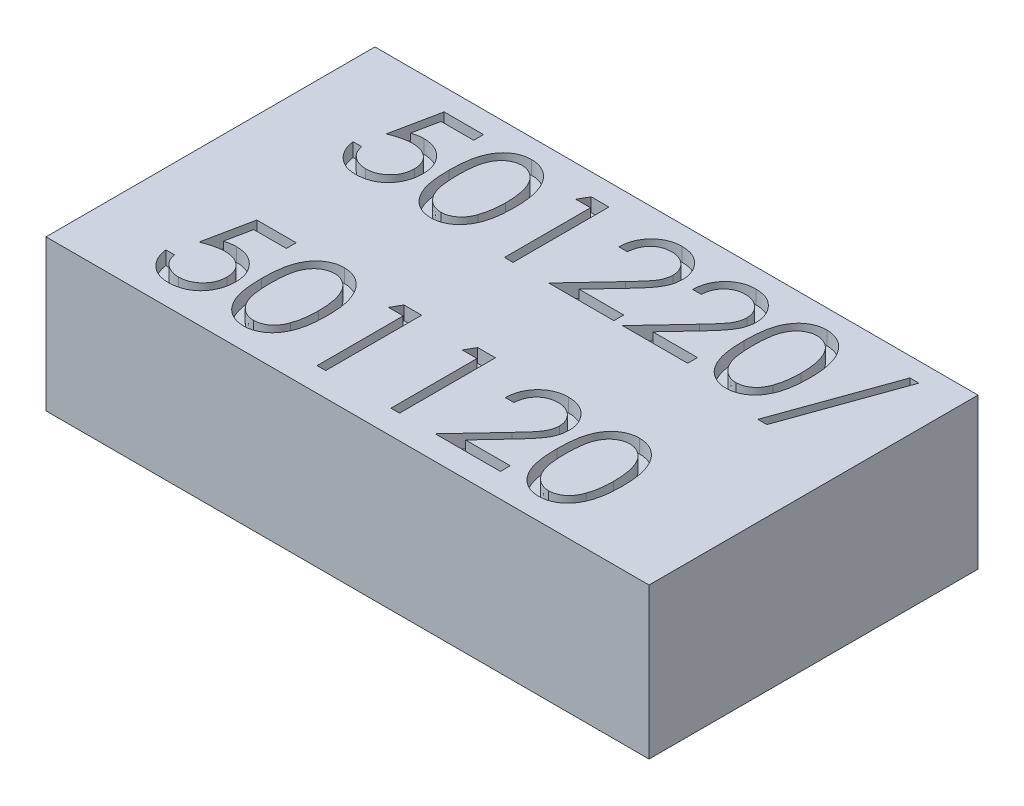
from build123d import *

# Parameters (mm, degrees)
SKETCH1_W           = 22
SKETCH1_H           = 12
BOSS_EXTRUDE1_DEPTH = 5.5
CUT_EXTRUDE1_DEPTH  = 0.5


with BuildPart() as part:
    # Sketch1 → Boss-Extrude1 (new body)
    with BuildSketch(Plane(origin=(0, 0, 0), x_dir=(1, 0, 0), z_dir=(0, 1, 0))):
        Rectangle(SKETCH1_W, SKETCH1_H)
    extrude(amount=BOSS_EXTRUDE1_DEPTH)

    # Sketch2 → Cut-Extrude1 (cut)
    # profile 1 of 13: a face of its own
    with BuildSketch(Plane(origin=(0, 5.5, 0), x_dir=(1, 0, 0), z_dir=(0, 1, 0))):
        with BuildLine():
            Line((-6.24945783, 5.209896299), (-6.24945783, 4.85092194))
            Line((-6.24945783, 4.85092194), (-7.439261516, 4.85092194))
            Line((-7.439261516, 4.85092194), (-7.6285644, 3.930349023))
            add(Edge.make_bspline(
                [(-7.6285644, 3.930349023), (-7.591508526, 3.940579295), (-7.51971863, 3.960398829), (-7.413758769, 3.982404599), (-7.313166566, 3.995670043), (-7.247891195, 3.997481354), (-7.216304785, 3.998357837)],
                knots=[0, 0, 0, 0, 1.100273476, 2.13160584, 3.095893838, 4, 4, 4, 4], degree=3))
            add(Edge.make_bspline(
                [(-7.216304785, 3.998357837), (-7.177221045, 3.997511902), (-7.100372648, 3.995848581), (-6.987933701, 3.979876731), (-6.880600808, 3.954736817), (-6.778598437, 3.919616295), (-6.681737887, 3.874706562), (-6.590910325, 3.818606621), (-6.504752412, 3.75307329), (-6.424809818, 3.677728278), (-6.35228551, 3.594806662), (-6.28851952, 3.505648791), (-6.23435693, 3.411121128), (-6.190796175, 3.31032052), (-6.156011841, 3.204361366), (-6.132859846, 3.092128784), (-6.117443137, 2.974680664), (-6.115720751, 2.894376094), (-6.114842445, 2.853425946)],
                knots=[0, 0, 0, 0, 1.052922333, 2.070308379, 3.05430497, 4.020497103, 4.973039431, 5.925935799, 6.892292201, 7.88610001, 8.88166317, 9.857072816, 10.836096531, 11.812156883, 12.81219415, 13.836441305, 14.89672472, 16, 16, 16, 16], degree=3))
            add(Edge.make_bspline(
                [(-6.114842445, 2.853425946), (-6.11550752, 2.824903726), (-6.116828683, 2.768244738), (-6.123547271, 2.684100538), (-6.136482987, 2.601737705), (-6.153850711, 2.521145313), (-6.176393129, 2.442475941), (-6.203682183, 2.365504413), (-6.23707821, 2.290709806), (-6.273709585, 2.217384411), (-6.314956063, 2.147185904), (-6.360734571, 2.081536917), (-6.409100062, 2.019452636), (-6.461141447, 1.961598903), (-6.517342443, 1.908355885), (-6.577022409, 1.859407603), (-6.639705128, 1.813926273), (-6.706360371, 1.773758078), (-6.775502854, 1.736795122), (-6.848131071, 1.706471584), (-6.922591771, 1.679361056), (-6.999956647, 1.657751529), (-7.08005046, 1.640818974), (-7.163005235, 1.629318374), (-7.248385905, 1.620941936), (-7.306260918, 1.620417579), (-7.33549549, 1.620152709)],
                knots=[0, 0, 0, 0, 1.056347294, 2.098418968, 3.122841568, 4.141288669, 5.149314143, 6.15115421, 7.162517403, 8.180376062, 9.185164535, 10.17417709, 11.141909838, 12.097768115, 13.052685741, 14.0056014, 14.954263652, 15.917497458, 16.885230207, 17.854509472, 18.828990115, 19.81800267, 20.826176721, 21.857883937, 22.917946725, 24, 24, 24, 24], degree=3))
            add(Edge.make_bspline(
                [(-7.33549549, 1.620152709), (-7.370369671, 1.620843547), (-7.438980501, 1.622202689), (-7.539501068, 1.636421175), (-7.636215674, 1.656785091), (-7.728345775, 1.687421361), (-7.816717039, 1.725808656), (-7.900139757, 1.774324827), (-7.980745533, 1.829303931), (-8.05525757, 1.894184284), (-8.124413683, 1.965099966), (-8.186320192, 2.042057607), (-8.241453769, 2.123787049), (-8.288931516, 2.210685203), (-8.329429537, 2.302523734), (-8.361244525, 2.399646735), (-8.38692288, 2.501546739), (-8.397786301, 2.571700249), (-8.403303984, 2.607332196)],
                knots=[0, 0, 0, 0, 1.0467383, 2.05933395, 3.04377827, 4.011590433, 4.970194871, 5.932262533, 6.905835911, 7.896367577, 8.894135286, 9.877477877, 10.858688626, 11.851381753, 12.8477658, 13.868841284, 14.917554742, 16, 16, 16, 16], degree=3))
            Line((-8.403303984, 2.607332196), (-8.089201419, 2.607332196))
            add(Edge.make_bspline(
                [(-8.089201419, 2.607332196), (-8.081472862, 2.573955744), (-8.066618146, 2.509804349), (-8.034012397, 2.419673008), (-7.994146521, 2.339353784), (-7.946742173, 2.267784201), (-7.890192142, 2.205375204), (-7.825662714, 2.149758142), (-7.75331499, 2.099583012), (-7.672921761, 2.057760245), (-7.588108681, 2.022091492), (-7.499341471, 1.998339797), (-7.409037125, 1.981638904), (-7.347958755, 1.979967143), (-7.317266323, 1.979127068)],
                knots=[0, 0, 0, 0, 1.136247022, 2.183929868, 3.172523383, 4.106158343, 5.02341133, 5.958108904, 6.928429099, 7.938127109, 8.96079061, 9.975095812, 10.982467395, 12, 12, 12, 12], degree=3))
            add(Edge.make_bspline(
                [(-7.317266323, 1.979127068), (-7.287307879, 1.979947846), (-7.228319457, 1.981563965), (-7.14150807, 1.994002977), (-7.057695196, 2.013160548), (-6.977707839, 2.041830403), (-6.900146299, 2.076675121), (-6.826972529, 2.121390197), (-6.756069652, 2.172850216), (-6.689641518, 2.231806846), (-6.628802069, 2.29677654), (-6.575045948, 2.366253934), (-6.530269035, 2.44037078), (-6.492534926, 2.517843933), (-6.463881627, 2.59952249), (-6.443440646, 2.685023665), (-6.431437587, 2.774558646), (-6.429786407, 2.835627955), (-6.428945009, 2.866747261)],
                knots=[0, 0, 0, 0, 1.027316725, 2.022795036, 3.002884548, 3.971462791, 4.93288096, 5.914575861, 6.907176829, 7.935150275, 8.956128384, 9.956726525, 10.942570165, 11.921478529, 12.907843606, 13.90538589, 14.932640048, 16, 16, 16, 16], degree=3))
            add(Edge.make_bspline(
                [(-6.428945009, 2.866747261), (-6.429603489, 2.894823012), (-6.430892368, 2.949777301), (-6.441422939, 3.030176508), (-6.459739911, 3.10624955), (-6.485163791, 3.178363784), (-6.517443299, 3.246587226), (-6.556889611, 3.310990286), (-6.604243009, 3.37072412), (-6.658334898, 3.425816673), (-6.717592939, 3.476661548), (-6.783036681, 3.520005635), (-6.853296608, 3.556469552), (-6.927526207, 3.587937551), (-7.007491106, 3.610538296), (-7.091607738, 3.627506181), (-7.180784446, 3.637321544), (-7.241755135, 3.638683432), (-7.27309565, 3.639383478)],
                knots=[0, 0, 0, 0, 1.045622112, 2.046656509, 3.013763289, 3.955457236, 4.890082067, 5.820317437, 6.762574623, 7.722996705, 8.69280354, 9.665887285, 10.63943826, 11.638615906, 12.663482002, 13.728887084, 14.832589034, 16, 16, 16, 16], degree=3))
            add(Edge.make_bspline(
                [(-7.27309565, 3.639383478), (-7.300224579, 3.638802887), (-7.356238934, 3.637604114), (-7.442161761, 3.628777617), (-7.532453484, 3.614538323), (-7.62676798, 3.594952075), (-7.725388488, 3.569320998), (-7.828106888, 3.538606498), (-7.935139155, 3.501884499), (-8.007256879, 3.474152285), (-8.044329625, 3.459896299)],
                knots=[0, 0, 0, 0, 0.817624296, 1.688186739, 2.600797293, 3.572016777, 4.590301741, 5.671205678, 6.80286297, 8, 8, 8, 8], degree=3))
            Line((-8.044329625, 3.459896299), (-7.685355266, 5.209896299))
            Line((-7.685355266, 5.209896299), (-6.24945783, 5.209896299))
        make_face()
    # profile 2 of 13: a face of its own
    with BuildSketch(Plane(origin=(0, 5.5, 0), x_dir=(1, 0, 0), z_dir=(0, 1, 0))):
        with BuildLine():
            add(Edge.make_bspline(
                [(-5.755868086, 3.458494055), (-5.755540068, 3.514591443), (-5.754902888, 3.623561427), (-5.747814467, 3.782346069), (-5.736039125, 3.931306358), (-5.719901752, 4.070449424), (-5.700263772, 4.199811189), (-5.674048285, 4.319045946), (-5.644235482, 4.428705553), (-5.609683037, 4.529147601), (-5.570695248, 4.621725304), (-5.528260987, 4.708150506), (-5.480696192, 4.788292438), (-5.430719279, 4.863430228), (-5.376307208, 4.932333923), (-5.319008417, 4.995976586), (-5.256586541, 5.052887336), (-5.191163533, 5.104733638), (-5.122147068, 5.15018311), (-5.051504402, 5.190215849), (-4.978749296, 5.224415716), (-4.903683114, 5.251306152), (-4.826980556, 5.273516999), (-4.748373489, 5.288705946), (-4.667732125, 5.298262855), (-4.61330069, 5.299176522), (-4.58569581, 5.299639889)],
                knots=[0, 0, 0, 0, 1.646270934, 3.197905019, 4.663502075, 6.030701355, 7.308322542, 8.50163776, 9.611534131, 10.641858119, 11.616356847, 12.558055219, 13.465016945, 14.349605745, 15.204443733, 16.039544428, 16.859896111, 17.680448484, 18.487036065, 19.28249412, 20.06191084, 20.843045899, 21.620316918, 22.403196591, 23.190181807, 24, 24, 24, 24], degree=3))
            add(Edge.make_bspline(
                [(-4.58569581, 5.299639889), (-4.557860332, 5.299152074), (-4.502504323, 5.298181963), (-4.420663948, 5.28885802), (-4.340714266, 5.273386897), (-4.262996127, 5.251465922), (-4.186871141, 5.224270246), (-4.112934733, 5.190183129), (-4.040727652, 5.150504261), (-3.971397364, 5.103880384), (-3.904182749, 5.051898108), (-3.840734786, 4.993135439), (-3.7810477, 4.92818572), (-3.724372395, 4.857743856), (-3.672316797, 4.780458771), (-3.622743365, 4.697674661), (-3.578371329, 4.607943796), (-3.535636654, 4.512763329), (-3.498749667, 4.40949967), (-3.465483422, 4.298734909), (-3.438604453, 4.179160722), (-3.416215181, 4.051404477), (-3.398870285, 3.914996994), (-3.386237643, 3.770230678), (-3.379564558, 3.617010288), (-3.378307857, 3.512252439), (-3.377662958, 3.458494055)],
                knots=[0, 0, 0, 0, 0.810914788, 1.612654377, 2.396697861, 3.181598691, 3.963628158, 4.749916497, 5.551656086, 6.361998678, 7.18212741, 8.025565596, 8.878627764, 9.750805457, 10.657531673, 11.591944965, 12.560506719, 13.57287815, 14.630710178, 15.753379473, 16.941251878, 18.199788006, 19.531962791, 20.947069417, 22.433333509, 24, 24, 24, 24], degree=3))
            add(Edge.make_bspline(
                [(-3.377662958, 3.458494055), (-3.378314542, 3.404970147), (-3.379584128, 3.300680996), (-3.386162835, 3.14815002), (-3.399121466, 3.004151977), (-3.415331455, 2.868341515), (-3.437782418, 2.741283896), (-3.465387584, 2.622539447), (-3.496037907, 2.511595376), (-3.533872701, 2.409360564), (-3.575283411, 2.314408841), (-3.620338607, 2.225741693), (-3.668608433, 2.1425754), (-3.721197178, 2.065575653), (-3.777250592, 1.994196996), (-3.83796838, 1.929699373), (-3.901638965, 1.870528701), (-3.969051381, 1.817877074), (-4.039462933, 1.771792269), (-4.111422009, 1.730578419), (-4.186205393, 1.697345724), (-4.262118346, 1.668810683), (-4.340246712, 1.647010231), (-4.420493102, 1.631936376), (-4.502449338, 1.621364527), (-4.557850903, 1.620558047), (-4.58569581, 1.620152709)],
                knots=[0, 0, 0, 0, 1.561518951, 3.042555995, 4.452378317, 5.7783523, 7.031515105, 8.214008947, 9.334062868, 10.386615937, 11.391082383, 12.354592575, 13.286541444, 14.194233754, 15.072674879, 15.931287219, 16.775624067, 17.606195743, 18.42308326, 19.229000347, 20.022332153, 20.807536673, 21.593273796, 22.3848459, 23.188221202, 24, 24, 24, 24], degree=3))
            add(Edge.make_bspline(
                [(-4.58569581, 1.620152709), (-4.613299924, 1.620619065), (-4.667729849, 1.621538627), (-4.748382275, 1.631052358), (-4.826664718, 1.646347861), (-4.902963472, 1.667764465), (-4.977669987, 1.693979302), (-5.049766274, 1.728132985), (-5.120053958, 1.767467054), (-5.188345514, 1.812262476), (-5.253357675, 1.863584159), (-5.31545628, 1.920348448), (-5.373081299, 1.983971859), (-5.426715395, 2.053449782), (-5.477689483, 2.128143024), (-5.524578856, 2.209071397), (-5.56794971, 2.295914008), (-5.607593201, 2.389231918), (-5.642741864, 2.490386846), (-5.673789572, 2.600536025), (-5.69830373, 2.720651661), (-5.719286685, 2.849769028), (-5.736211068, 2.988442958), (-5.747765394, 3.136748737), (-5.754906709, 3.294593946), (-5.755541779, 3.40286372), (-5.755868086, 3.458494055)],
                knots=[0, 0, 0, 0, 0.810891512, 1.598919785, 2.382837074, 3.152667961, 3.926044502, 4.706494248, 5.493654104, 6.291793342, 7.103789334, 7.925228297, 8.761435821, 9.622817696, 10.50288917, 11.416980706, 12.369136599, 13.353924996, 14.394355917, 15.514179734, 16.714354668, 17.994756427, 19.357759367, 20.818452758, 22.365282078, 24, 24, 24, 24], degree=3))
        make_face()
        with BuildLine():
            add(Edge.make_bspline(
                [(-5.441765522, 3.459896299), (-5.441646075, 3.4131476), (-5.441414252, 3.322417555), (-5.435358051, 3.190574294), (-5.427107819, 3.067603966), (-5.416466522, 2.953350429), (-5.400663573, 2.848200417), (-5.382956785, 2.751430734), (-5.361408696, 2.663553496), (-5.335913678, 2.583965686), (-5.306874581, 2.511316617), (-5.275168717, 2.443715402), (-5.241107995, 2.380363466), (-5.202988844, 2.321829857), (-5.161473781, 2.267923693), (-5.117500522, 2.217690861), (-5.069427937, 2.17289388), (-5.002924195, 2.119167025), (-4.91512772, 2.063647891), (-4.804507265, 2.015301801), (-4.690838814, 1.984919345), (-4.613687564, 1.981055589), (-4.575178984, 1.979127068)],
                knots=[0, 0, 0, 0, 1.459021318, 2.831673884, 4.118529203, 5.306027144, 6.411944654, 7.436330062, 8.375795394, 9.233974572, 10.042671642, 10.816086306, 11.563610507, 12.285937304, 12.993564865, 13.685989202, 14.367179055, 15.041617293, 16.353048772, 17.594441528, 18.799311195, 20, 20, 20, 20], degree=3))
            add(Edge.make_bspline(
                [(-4.575178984, 1.979127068), (-4.536421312, 1.980724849), (-4.458985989, 1.983917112), (-4.345852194, 2.014715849), (-4.236021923, 2.061185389), (-4.149949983, 2.116132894), (-4.08446744, 2.168461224), (-4.03755045, 2.213075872), (-3.994488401, 2.263031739), (-3.953646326, 2.316931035), (-3.916187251, 2.375803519), (-3.882124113, 2.439366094), (-3.851040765, 2.507795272), (-3.833331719, 2.555565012), (-3.824277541, 2.579988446)],
                knots=[0, 0, 0, 0, 1.353760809, 2.704726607, 4.075137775, 5.516104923, 6.260822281, 7.007110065, 7.778089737, 8.566572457, 9.372053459, 10.217411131, 11.088608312, 12, 12, 12, 12], degree=3))
            add(Edge.make_bspline(
                [(-3.824277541, 2.579988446), (-3.813725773, 2.611218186), (-3.79230116, 2.67462795), (-3.764689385, 2.772991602), (-3.742943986, 2.876194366), (-3.72338062, 2.983619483), (-3.710027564, 3.096059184), (-3.699279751, 3.213165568), (-3.692949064, 3.33502693), (-3.692164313, 3.417821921), (-3.691765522, 3.459896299)],
                knots=[0, 0, 0, 0, 0.884706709, 1.796334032, 2.740027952, 3.714592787, 4.726048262, 5.777819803, 6.87074269, 8, 8, 8, 8], degree=3))
            add(Edge.make_bspline(
                [(-3.691765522, 3.459896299), (-3.692315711, 3.501963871), (-3.693391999, 3.584257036), (-3.697505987, 3.704775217), (-3.708129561, 3.819242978), (-3.71992868, 3.928153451), (-3.737325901, 4.030903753), (-3.756083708, 4.128354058), (-3.78128492, 4.219297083), (-3.808204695, 4.305156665), (-3.839015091, 4.384957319), (-3.872930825, 4.459071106), (-3.909152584, 4.527855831), (-3.948494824, 4.591122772), (-3.990490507, 4.649155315), (-4.036248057, 4.70078991), (-4.083952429, 4.747626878), (-4.150769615, 4.801089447), (-4.238243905, 4.855601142), (-4.347089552, 4.905766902), (-4.460360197, 4.934575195), (-4.536933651, 4.938636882), (-4.575178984, 4.94066553)],
                knots=[0, 0, 0, 0, 1.31362396, 2.569729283, 3.763502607, 4.902122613, 5.988968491, 7.01645872, 7.998833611, 8.933434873, 9.825090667, 10.667526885, 11.477055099, 12.250526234, 12.991942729, 13.710640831, 14.402115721, 15.076753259, 16.378508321, 17.609869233, 18.806226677, 20, 20, 20, 20], degree=3))
            add(Edge.make_bspline(
                [(-4.575178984, 4.94066553), (-4.613889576, 4.938634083), (-4.691381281, 4.934567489), (-4.805829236, 4.905874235), (-4.915533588, 4.855861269), (-5.002776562, 4.800908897), (-5.069640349, 4.748570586), (-5.116723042, 4.703184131), (-5.160869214, 4.653537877), (-5.201536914, 4.599135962), (-5.239626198, 4.540670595), (-5.27460721, 4.47768183), (-5.30612454, 4.409850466), (-5.335209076, 4.337234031), (-5.360781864, 4.257653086), (-5.381875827, 4.169884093), (-5.40136288, 4.073422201), (-5.415158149, 3.967702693), (-5.427421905, 3.853420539), (-5.435303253, 3.730143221), (-5.441434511, 3.598078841), (-5.441652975, 3.506879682), (-5.441765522, 3.459896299)],
                knots=[0, 0, 0, 0, 1.207732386, 2.417664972, 3.655092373, 4.956220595, 5.625982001, 6.301752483, 6.994047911, 7.697131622, 8.419323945, 9.170223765, 9.943494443, 10.752040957, 11.610060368, 12.549350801, 13.567764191, 14.679664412, 15.874934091, 17.154273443, 18.533957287, 20, 20, 20, 20], degree=3))
        make_face(mode=Mode.SUBTRACT)
    # profile 3 of 13: a face of its own
    with BuildSketch(Plane(origin=(0, 5.5, 0), x_dir=(1, 0, 0), z_dir=(0, 1, 0))):
        Polygon((-2.319670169, 5.209896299), (-1.672534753, 5.209896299), (-1.672534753, 1.709896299), (-1.986637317, 1.709896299), (-1.986637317, 4.85092194), (-2.525098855, 4.85092194), align=None)
    # profile 4 of 13: a face of its own
    with BuildSketch(Plane(origin=(0, 5.5, 0), x_dir=(1, 0, 0), z_dir=(0, 1, 0))):
        with BuildLine():
            Line((0.077465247, 4.132973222), (-0.236637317, 4.132973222))
            add(Edge.make_bspline(
                [(-0.236637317, 4.132973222), (-0.234590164, 4.17464411), (-0.23056961, 4.256484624), (-0.211741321, 4.375808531), (-0.184800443, 4.48986333), (-0.146708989, 4.597733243), (-0.099402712, 4.700372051), (-0.042672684, 4.797372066), (0.024521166, 4.888363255), (0.1007279, 4.972502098), (0.183496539, 5.049689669), (0.272802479, 5.116344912), (0.366647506, 5.172662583), (0.464746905, 5.219743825), (0.568207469, 5.255083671), (0.676090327, 5.281305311), (0.788869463, 5.297081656), (0.865709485, 5.298777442), (0.904788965, 5.299639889)],
                knots=[0, 0, 0, 0, 1.10065271, 2.161652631, 3.183658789, 4.190468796, 5.17591951, 6.163126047, 7.15150782, 8.156236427, 9.156009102, 10.134482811, 11.092018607, 12.041330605, 13.001268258, 13.972401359, 14.968799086, 16, 16, 16, 16], degree=3))
            add(Edge.make_bspline(
                [(0.904788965, 5.299639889), (0.943167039, 5.298741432), (1.018578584, 5.296975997), (1.128640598, 5.281814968), (1.233417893, 5.258069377), (1.332705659, 5.22475396), (1.425711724, 5.179969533), (1.513134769, 5.126171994), (1.596015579, 5.063952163), (1.670622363, 4.990698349), (1.739130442, 4.912495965), (1.798232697, 4.829008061), (1.848845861, 4.742778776), (1.891033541, 4.653150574), (1.92208968, 4.559279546), (1.945667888, 4.462532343), (1.958995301, 4.361907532), (1.961040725, 4.293800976), (1.962080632, 4.259175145)],
                knots=[0, 0, 0, 0, 1.111607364, 2.184268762, 3.212621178, 4.221274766, 5.211760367, 6.196651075, 7.1921475, 8.207485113, 9.220403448, 10.201281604, 11.166441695, 12.114753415, 13.065576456, 14.026450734, 14.996634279, 16, 16, 16, 16], degree=3))
            add(Edge.make_bspline(
                [(1.962080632, 4.259175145), (1.960393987, 4.210425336), (1.957050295, 4.113781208), (1.928194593, 3.97157685), (1.883612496, 3.833671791), (1.829539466, 3.722692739), (1.774918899, 3.633715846), (1.726739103, 3.559800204), (1.66908675, 3.480973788), (1.602489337, 3.396442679), (1.527951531, 3.305948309), (1.444936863, 3.209453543), (1.352811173, 3.107983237), (1.288152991, 3.038677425), (1.254648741, 3.002764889)],
                knots=[0, 0, 0, 0, 1.184203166, 2.347625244, 3.513805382, 4.700623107, 5.337941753, 6.051866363, 6.845199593, 7.711357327, 8.668078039, 9.695487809, 10.805859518, 12, 12, 12, 12], degree=3))
            Line((1.254648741, 3.002764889), (0.378947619, 2.068870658))
            Line((0.378947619, 2.068870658), (2.006952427, 2.068870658))
            Line((2.006952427, 2.068870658), (2.006952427, 1.709896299))
            Line((2.006952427, 1.709896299), (-0.371252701, 1.709896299))
            Line((-0.371252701, 1.709896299), (0.986119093, 3.158413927))
            add(Edge.make_bspline(
                [(0.986119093, 3.158413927), (1.01916698, 3.192912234), (1.082645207, 3.25917642), (1.172427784, 3.35591938), (1.253066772, 3.445668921), (1.325084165, 3.52825547), (1.386917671, 3.604887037), (1.441789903, 3.673081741), (1.485755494, 3.735836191), (1.533470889, 3.808576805), (1.579684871, 3.897389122), (1.619397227, 4.005922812), (1.643612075, 4.117650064), (1.646516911, 4.193152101), (1.647978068, 4.231130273)],
                knots=[0, 0, 0, 0, 1.329631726, 2.553950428, 3.673215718, 4.687767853, 5.603093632, 6.413772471, 7.123043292, 7.734684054, 8.834405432, 9.900288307, 10.943827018, 12, 12, 12, 12], degree=3))
            add(Edge.make_bspline(
                [(1.647978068, 4.231130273), (1.647342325, 4.255011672), (1.646089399, 4.302077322), (1.635031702, 4.371083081), (1.618321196, 4.437647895), (1.594375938, 4.501976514), (1.562769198, 4.563422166), (1.524295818, 4.622059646), (1.479905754, 4.678748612), (1.428554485, 4.73190191), (1.372142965, 4.780583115), (1.312548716, 4.8237072), (1.249498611, 4.859746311), (1.183258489, 4.889289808), (1.11401302, 4.91246519), (1.041628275, 4.928523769), (0.966304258, 4.938606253), (0.914870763, 4.939970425), (0.888663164, 4.94066553)],
                knots=[0, 0, 0, 0, 0.991446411, 1.95395049, 2.89581595, 3.838931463, 4.798493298, 5.75982156, 6.748411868, 7.785213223, 8.824556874, 9.840280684, 10.836137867, 11.835679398, 12.848801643, 13.863922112, 14.911575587, 16, 16, 16, 16], degree=3))
            add(Edge.make_bspline(
                [(0.888663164, 4.94066553), (0.861292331, 4.939950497), (0.807540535, 4.938546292), (0.728621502, 4.928723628), (0.653335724, 4.911777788), (0.581493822, 4.888601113), (0.512974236, 4.859142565), (0.448110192, 4.82245082), (0.387047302, 4.778667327), (0.329670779, 4.72902677), (0.2768068, 4.673759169), (0.230359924, 4.612149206), (0.18977591, 4.545321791), (0.154366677, 4.47345724), (0.125610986, 4.39590346), (0.103637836, 4.312935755), (0.086250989, 4.224914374), (0.080442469, 4.164129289), (0.077465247, 4.132973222)],
                knots=[0, 0, 0, 0, 1.031018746, 2.02475058, 2.990194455, 3.934040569, 4.864654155, 5.795059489, 6.735614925, 7.690564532, 8.649604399, 9.611025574, 10.590972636, 11.591080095, 12.624614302, 13.701020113, 14.821632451, 16, 16, 16, 16], degree=3))
        make_face()
    # profile 5 of 13: a face of its own
    with BuildSketch(Plane(origin=(0, 5.5, 0), x_dir=(1, 0, 0), z_dir=(0, 1, 0))):
        with BuildLine():
            Line((2.76977294, 4.132973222), (2.455670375, 4.132973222))
            add(Edge.make_bspline(
                [(2.455670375, 4.132973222), (2.457717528, 4.17464411), (2.461738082, 4.256484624), (2.480566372, 4.375808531), (2.507507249, 4.48986333), (2.545598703, 4.597733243), (2.592904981, 4.700372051), (2.649635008, 4.797372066), (2.716828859, 4.888363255), (2.793035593, 4.972502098), (2.875804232, 5.049689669), (2.965110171, 5.116344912), (3.058955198, 5.172662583), (3.157054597, 5.219743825), (3.260515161, 5.255083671), (3.368398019, 5.281305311), (3.481177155, 5.297081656), (3.558017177, 5.298777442), (3.597096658, 5.299639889)],
                knots=[0, 0, 0, 0, 1.10065271, 2.161652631, 3.183658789, 4.190468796, 5.17591951, 6.163126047, 7.15150782, 8.156236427, 9.156009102, 10.134482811, 11.092018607, 12.041330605, 13.001268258, 13.972401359, 14.968799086, 16, 16, 16, 16], degree=3))
            add(Edge.make_bspline(
                [(3.597096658, 5.299639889), (3.635474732, 5.298741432), (3.710886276, 5.296975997), (3.820948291, 5.281814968), (3.925725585, 5.258069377), (4.025013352, 5.22475396), (4.118019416, 5.179969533), (4.205442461, 5.126171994), (4.288323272, 5.063952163), (4.362930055, 4.990698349), (4.431438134, 4.912495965), (4.49054039, 4.829008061), (4.541153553, 4.742778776), (4.583341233, 4.653150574), (4.614397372, 4.559279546), (4.63797558, 4.462532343), (4.651302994, 4.361907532), (4.653348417, 4.293800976), (4.654388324, 4.259175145)],
                knots=[0, 0, 0, 0, 1.111607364, 2.184268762, 3.212621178, 4.221274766, 5.211760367, 6.196651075, 7.1921475, 8.207485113, 9.220403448, 10.201281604, 11.166441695, 12.114753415, 13.065576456, 14.026450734, 14.996634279, 16, 16, 16, 16], degree=3))
            add(Edge.make_bspline(
                [(4.654388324, 4.259175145), (4.652701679, 4.210425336), (4.649357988, 4.113781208), (4.620502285, 3.97157685), (4.575920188, 3.833671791), (4.521847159, 3.722692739), (4.467226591, 3.633715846), (4.419046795, 3.559800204), (4.361394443, 3.480973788), (4.294797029, 3.396442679), (4.220259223, 3.305948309), (4.137244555, 3.209453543), (4.045118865, 3.107983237), (3.980460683, 3.038677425), (3.946956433, 3.002764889)],
                knots=[0, 0, 0, 0, 1.184203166, 2.347625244, 3.513805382, 4.700623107, 5.337941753, 6.051866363, 6.845199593, 7.711357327, 8.668078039, 9.695487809, 10.805859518, 12, 12, 12, 12], degree=3))
            Line((3.946956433, 3.002764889), (3.071255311, 2.068870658))
            Line((3.071255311, 2.068870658), (4.699260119, 2.068870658))
            Line((4.699260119, 2.068870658), (4.699260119, 1.709896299))
            Line((4.699260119, 1.709896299), (2.321054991, 1.709896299))
            Line((2.321054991, 1.709896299), (3.678426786, 3.158413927))
            add(Edge.make_bspline(
                [(3.678426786, 3.158413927), (3.711474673, 3.192912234), (3.7749529, 3.25917642), (3.864735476, 3.35591938), (3.945374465, 3.445668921), (4.017391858, 3.52825547), (4.079225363, 3.604887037), (4.134097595, 3.673081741), (4.178063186, 3.735836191), (4.225778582, 3.808576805), (4.271992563, 3.897389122), (4.311704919, 4.005922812), (4.335919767, 4.117650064), (4.338824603, 4.193152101), (4.34028576, 4.231130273)],
                knots=[0, 0, 0, 0, 1.329631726, 2.553950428, 3.673215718, 4.687767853, 5.603093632, 6.413772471, 7.123043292, 7.734684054, 8.834405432, 9.900288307, 10.943827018, 12, 12, 12, 12], degree=3))
            add(Edge.make_bspline(
                [(4.34028576, 4.231130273), (4.339650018, 4.255011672), (4.338397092, 4.302077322), (4.327339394, 4.371083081), (4.310628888, 4.437647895), (4.28668363, 4.501976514), (4.25507689, 4.563422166), (4.21660351, 4.622059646), (4.172213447, 4.678748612), (4.120862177, 4.73190191), (4.064450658, 4.780583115), (4.004856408, 4.8237072), (3.941806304, 4.859746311), (3.875566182, 4.889289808), (3.806320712, 4.91246519), (3.733935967, 4.928523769), (3.658611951, 4.938606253), (3.607178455, 4.939970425), (3.580970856, 4.94066553)],
                knots=[0, 0, 0, 0, 0.991446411, 1.95395049, 2.89581595, 3.838931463, 4.798493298, 5.75982156, 6.748411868, 7.785213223, 8.824556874, 9.840280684, 10.836137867, 11.835679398, 12.848801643, 13.863922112, 14.911575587, 16, 16, 16, 16], degree=3))
            add(Edge.make_bspline(
                [(3.580970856, 4.94066553), (3.553600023, 4.939950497), (3.499848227, 4.938546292), (3.420929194, 4.928723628), (3.345643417, 4.911777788), (3.273801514, 4.888601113), (3.205281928, 4.859142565), (3.140417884, 4.82245082), (3.079354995, 4.778667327), (3.021978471, 4.72902677), (2.969114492, 4.673759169), (2.922667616, 4.612149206), (2.882083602, 4.545321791), (2.846674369, 4.47345724), (2.817918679, 4.39590346), (2.795945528, 4.312935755), (2.778558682, 4.224914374), (2.772750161, 4.164129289), (2.76977294, 4.132973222)],
                knots=[0, 0, 0, 0, 1.031018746, 2.02475058, 2.990194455, 3.934040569, 4.864654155, 5.795059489, 6.735614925, 7.690564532, 8.649604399, 9.611025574, 10.590972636, 11.591080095, 12.624614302, 13.701020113, 14.821632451, 16, 16, 16, 16], degree=3))
        make_face()
    # profile 6 of 13: a face of its own
    with BuildSketch(Plane(origin=(0, 5.5, 0), x_dir=(1, 0, 0), z_dir=(0, 1, 0))):
        with BuildLine():
            add(Edge.make_bspline(
                [(5.013362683, 3.458494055), (5.013690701, 3.514591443), (5.014327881, 3.623561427), (5.021416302, 3.782346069), (5.033191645, 3.931306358), (5.049329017, 4.070449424), (5.068966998, 4.199811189), (5.095182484, 4.319045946), (5.124995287, 4.428705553), (5.159547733, 4.529147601), (5.198535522, 4.621725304), (5.240969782, 4.708150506), (5.288534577, 4.788292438), (5.33851149, 4.863430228), (5.392923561, 4.932333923), (5.450222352, 4.995976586), (5.512644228, 5.052887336), (5.578067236, 5.104733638), (5.647083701, 5.15018311), (5.717726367, 5.190215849), (5.790481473, 5.224415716), (5.865547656, 5.251306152), (5.942250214, 5.273516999), (6.02085728, 5.288705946), (6.101498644, 5.298262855), (6.155930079, 5.299176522), (6.183534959, 5.299639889)],
                knots=[0, 0, 0, 0, 1.646270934, 3.197905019, 4.663502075, 6.030701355, 7.308322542, 8.50163776, 9.611534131, 10.641858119, 11.616356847, 12.558055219, 13.465016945, 14.349605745, 15.204443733, 16.039544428, 16.859896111, 17.680448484, 18.487036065, 19.28249412, 20.06191084, 20.843045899, 21.620316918, 22.403196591, 23.190181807, 24, 24, 24, 24], degree=3))
            add(Edge.make_bspline(
                [(6.183534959, 5.299639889), (6.211370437, 5.299152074), (6.266726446, 5.298181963), (6.348566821, 5.28885802), (6.428516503, 5.273386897), (6.506234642, 5.251465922), (6.582359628, 5.224270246), (6.656296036, 5.190183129), (6.728503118, 5.150504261), (6.797833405, 5.103880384), (6.86504802, 5.051898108), (6.928495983, 4.993135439), (6.988183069, 4.92818572), (7.044858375, 4.857743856), (7.096913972, 4.780458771), (7.146487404, 4.697674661), (7.19085944, 4.607943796), (7.233594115, 4.512763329), (7.270481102, 4.40949967), (7.303747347, 4.298734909), (7.330626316, 4.179160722), (7.353015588, 4.051404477), (7.370360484, 3.914996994), (7.382993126, 3.770230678), (7.389666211, 3.617010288), (7.390922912, 3.512252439), (7.391567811, 3.458494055)],
                knots=[0, 0, 0, 0, 0.810914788, 1.612654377, 2.396697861, 3.181598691, 3.963628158, 4.749916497, 5.551656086, 6.361998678, 7.18212741, 8.025565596, 8.878627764, 9.750805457, 10.657531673, 11.591944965, 12.560506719, 13.57287815, 14.630710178, 15.753379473, 16.941251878, 18.199788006, 19.531962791, 20.947069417, 22.433333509, 24, 24, 24, 24], degree=3))
            add(Edge.make_bspline(
                [(7.391567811, 3.458494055), (7.390916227, 3.404970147), (7.389646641, 3.300680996), (7.383067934, 3.14815002), (7.370109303, 3.004151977), (7.353899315, 2.868341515), (7.331448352, 2.741283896), (7.303843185, 2.622539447), (7.273192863, 2.511595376), (7.235358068, 2.409360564), (7.193947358, 2.314408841), (7.148892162, 2.225741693), (7.100622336, 2.1425754), (7.048033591, 2.065575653), (6.991980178, 1.994196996), (6.931262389, 1.929699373), (6.867591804, 1.870528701), (6.800179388, 1.817877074), (6.729767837, 1.771792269), (6.65780876, 1.730578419), (6.583025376, 1.697345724), (6.507112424, 1.668810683), (6.428984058, 1.647010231), (6.348737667, 1.631936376), (6.266781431, 1.621364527), (6.211379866, 1.620558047), (6.183534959, 1.620152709)],
                knots=[0, 0, 0, 0, 1.561518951, 3.042555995, 4.452378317, 5.7783523, 7.031515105, 8.214008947, 9.334062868, 10.386615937, 11.391082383, 12.354592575, 13.286541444, 14.194233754, 15.072674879, 15.931287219, 16.775624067, 17.606195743, 18.42308326, 19.229000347, 20.022332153, 20.807536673, 21.593273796, 22.3848459, 23.188221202, 24, 24, 24, 24], degree=3))
            add(Edge.make_bspline(
                [(6.183534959, 1.620152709), (6.155930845, 1.620619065), (6.10150092, 1.621538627), (6.020848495, 1.631052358), (5.942566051, 1.646347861), (5.866267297, 1.667764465), (5.791560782, 1.693979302), (5.719464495, 1.728132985), (5.649176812, 1.767467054), (5.580885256, 1.812262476), (5.515873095, 1.863584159), (5.453774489, 1.920348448), (5.39614947, 1.983971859), (5.342515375, 2.053449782), (5.291541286, 2.128143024), (5.244651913, 2.209071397), (5.201281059, 2.295914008), (5.161637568, 2.389231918), (5.126488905, 2.490386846), (5.095441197, 2.600536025), (5.070927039, 2.720651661), (5.049944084, 2.849769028), (5.033019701, 2.988442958), (5.021465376, 3.136748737), (5.014324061, 3.294593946), (5.01368899, 3.40286372), (5.013362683, 3.458494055)],
                knots=[0, 0, 0, 0, 0.810891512, 1.598919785, 2.382837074, 3.152667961, 3.926044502, 4.706494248, 5.493654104, 6.291793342, 7.103789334, 7.925228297, 8.761435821, 9.622817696, 10.50288917, 11.416980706, 12.369136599, 13.353924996, 14.394355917, 15.514179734, 16.714354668, 17.994756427, 19.357759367, 20.818452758, 22.365282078, 24, 24, 24, 24], degree=3))
        make_face()
        with BuildLine():
            add(Edge.make_bspline(
                [(5.327465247, 3.459896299), (5.327584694, 3.4131476), (5.327816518, 3.322417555), (5.333872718, 3.190574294), (5.34212295, 3.067603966), (5.352764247, 2.953350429), (5.368567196, 2.848200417), (5.386273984, 2.751430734), (5.407822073, 2.663553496), (5.433317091, 2.583965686), (5.462356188, 2.511316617), (5.494062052, 2.443715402), (5.528122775, 2.380363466), (5.566241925, 2.321829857), (5.607756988, 2.267923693), (5.651730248, 2.217690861), (5.699802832, 2.17289388), (5.766306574, 2.119167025), (5.854103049, 2.063647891), (5.964723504, 2.015301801), (6.078391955, 1.984919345), (6.155543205, 1.981055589), (6.194051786, 1.979127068)],
                knots=[0, 0, 0, 0, 1.459021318, 2.831673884, 4.118529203, 5.306027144, 6.411944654, 7.436330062, 8.375795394, 9.233974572, 10.042671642, 10.816086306, 11.563610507, 12.285937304, 12.993564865, 13.685989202, 14.367179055, 15.041617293, 16.353048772, 17.594441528, 18.799311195, 20, 20, 20, 20], degree=3))
            add(Edge.make_bspline(
                [(6.194051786, 1.979127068), (6.232809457, 1.980724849), (6.310244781, 1.983917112), (6.423378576, 2.014715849), (6.533208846, 2.061185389), (6.619280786, 2.116132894), (6.68476333, 2.168461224), (6.73168032, 2.213075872), (6.774742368, 2.263031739), (6.815584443, 2.316931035), (6.853043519, 2.375803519), (6.887106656, 2.439366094), (6.918190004, 2.507795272), (6.93589905, 2.555565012), (6.944953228, 2.579988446)],
                knots=[0, 0, 0, 0, 1.353760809, 2.704726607, 4.075137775, 5.516104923, 6.260822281, 7.007110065, 7.778089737, 8.566572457, 9.372053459, 10.217411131, 11.088608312, 12, 12, 12, 12], degree=3))
            add(Edge.make_bspline(
                [(6.944953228, 2.579988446), (6.955504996, 2.611218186), (6.97692961, 2.67462795), (7.004541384, 2.772991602), (7.026286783, 2.876194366), (7.045850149, 2.983619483), (7.059203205, 3.096059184), (7.069951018, 3.213165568), (7.076281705, 3.33502693), (7.077066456, 3.417821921), (7.077465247, 3.459896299)],
                knots=[0, 0, 0, 0, 0.884706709, 1.796334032, 2.740027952, 3.714592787, 4.726048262, 5.777819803, 6.87074269, 8, 8, 8, 8], degree=3))
            add(Edge.make_bspline(
                [(7.077465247, 3.459896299), (7.076915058, 3.501963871), (7.07583877, 3.584257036), (7.071724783, 3.704775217), (7.061101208, 3.819242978), (7.049302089, 3.928153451), (7.031904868, 4.030903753), (7.013147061, 4.128354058), (6.987945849, 4.219297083), (6.961026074, 4.305156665), (6.930215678, 4.384957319), (6.896299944, 4.459071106), (6.860078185, 4.527855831), (6.820735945, 4.591122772), (6.778740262, 4.649155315), (6.732982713, 4.70078991), (6.68527834, 4.747626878), (6.618461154, 4.801089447), (6.530986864, 4.855601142), (6.422141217, 4.905766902), (6.308870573, 4.934575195), (6.232297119, 4.938636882), (6.194051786, 4.94066553)],
                knots=[0, 0, 0, 0, 1.31362396, 2.569729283, 3.763502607, 4.902122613, 5.988968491, 7.01645872, 7.998833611, 8.933434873, 9.825090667, 10.667526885, 11.477055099, 12.250526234, 12.991942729, 13.710640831, 14.402115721, 15.076753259, 16.378508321, 17.609869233, 18.806226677, 20, 20, 20, 20], degree=3))
            add(Edge.make_bspline(
                [(6.194051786, 4.94066553), (6.155341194, 4.938634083), (6.077849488, 4.934567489), (5.963401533, 4.905874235), (5.853697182, 4.855861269), (5.766454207, 4.800908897), (5.69959042, 4.748570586), (5.652507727, 4.703184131), (5.608361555, 4.653537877), (5.567693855, 4.599135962), (5.529604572, 4.540670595), (5.494623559, 4.47768183), (5.463106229, 4.409850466), (5.434021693, 4.337234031), (5.408448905, 4.257653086), (5.387354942, 4.169884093), (5.367867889, 4.073422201), (5.35407262, 3.967702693), (5.341808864, 3.853420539), (5.333927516, 3.730143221), (5.327796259, 3.598078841), (5.327577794, 3.506879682), (5.327465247, 3.459896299)],
                knots=[0, 0, 0, 0, 1.207732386, 2.417664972, 3.655092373, 4.956220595, 5.625982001, 6.301752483, 6.994047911, 7.697131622, 8.419323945, 9.170223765, 9.943494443, 10.752040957, 11.610060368, 12.549350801, 13.567764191, 14.679664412, 15.874934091, 17.154273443, 18.533957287, 20, 20, 20, 20], degree=3))
        make_face(mode=Mode.SUBTRACT)
    # profile 7 of 13: a face of its own
    with BuildSketch(Plane(origin=(0, 5.5, 0), x_dir=(1, 0, 0), z_dir=(0, 1, 0))):
        Polygon((9.545413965, 5.299639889), (8.081471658, 1.216306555), (7.75054217, 1.216306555), (9.214484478, 5.299639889), align=None)
    # profile 8 of 13: a face of its own
    with BuildSketch(Plane(origin=(0, 5.5, 0), x_dir=(1, 0, 0), z_dir=(0, 1, 0))):
        with BuildLine():
            Line((-6.24945783, -1.623437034), (-6.24945783, -1.982411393))
            Line((-6.24945783, -1.982411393), (-7.439261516, -1.982411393))
            Line((-7.439261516, -1.982411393), (-7.6285644, -2.90298431))
            add(Edge.make_bspline(
                [(-7.6285644, -2.90298431), (-7.591508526, -2.892754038), (-7.51971863, -2.872934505), (-7.413758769, -2.850928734), (-7.313166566, -2.83766329), (-7.247891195, -2.83585198), (-7.216304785, -2.834975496)],
                knots=[0, 0, 0, 0, 1.100273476, 2.13160584, 3.095893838, 4, 4, 4, 4], degree=3))
            add(Edge.make_bspline(
                [(-7.216304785, -2.834975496), (-7.177221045, -2.835821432), (-7.100372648, -2.837484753), (-6.987933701, -2.853456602), (-6.880600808, -2.878596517), (-6.778598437, -2.913717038), (-6.681737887, -2.958626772), (-6.590910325, -3.014726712), (-6.504752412, -3.080260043), (-6.424809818, -3.155605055), (-6.35228551, -3.238526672), (-6.28851952, -3.327684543), (-6.23435693, -3.422212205), (-6.190796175, -3.523012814), (-6.156011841, -3.628971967), (-6.132859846, -3.74120455), (-6.117443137, -3.85865267), (-6.115720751, -3.93895724), (-6.114842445, -3.979907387)],
                knots=[0, 0, 0, 0, 1.052922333, 2.070308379, 3.05430497, 4.020497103, 4.973039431, 5.925935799, 6.892292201, 7.88610001, 8.88166317, 9.857072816, 10.836096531, 11.812156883, 12.81219415, 13.836441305, 14.89672472, 16, 16, 16, 16], degree=3))
            add(Edge.make_bspline(
                [(-6.114842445, -3.979907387), (-6.11550752, -4.008429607), (-6.116828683, -4.065088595), (-6.123547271, -4.149232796), (-6.136482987, -4.231595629), (-6.153850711, -4.31218802), (-6.176393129, -4.390857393), (-6.203682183, -4.467828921), (-6.23707821, -4.542623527), (-6.273709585, -4.615948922), (-6.314956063, -4.68614743), (-6.360734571, -4.751796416), (-6.409100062, -4.813880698), (-6.461141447, -4.871734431), (-6.517342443, -4.924977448), (-6.577022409, -4.97392573), (-6.639705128, -5.01940706), (-6.706360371, -5.059575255), (-6.775502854, -5.096538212), (-6.848131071, -5.126861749), (-6.922591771, -5.153972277), (-6.999956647, -5.175581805), (-7.08005046, -5.192514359), (-7.163005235, -5.20401496), (-7.248385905, -5.212391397), (-7.306260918, -5.212915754), (-7.33549549, -5.213180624)],
                knots=[0, 0, 0, 0, 1.056347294, 2.098418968, 3.122841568, 4.141288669, 5.149314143, 6.15115421, 7.162517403, 8.180376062, 9.185164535, 10.17417709, 11.141909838, 12.097768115, 13.052685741, 14.0056014, 14.954263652, 15.917497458, 16.885230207, 17.854509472, 18.828990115, 19.81800267, 20.826176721, 21.857883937, 22.917946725, 24, 24, 24, 24], degree=3))
            add(Edge.make_bspline(
                [(-7.33549549, -5.213180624), (-7.370369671, -5.212489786), (-7.438980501, -5.211130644), (-7.539501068, -5.196912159), (-7.636215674, -5.176548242), (-7.728345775, -5.145911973), (-7.816717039, -5.107524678), (-7.900139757, -5.059008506), (-7.980745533, -5.004029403), (-8.05525757, -4.93914905), (-8.124413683, -4.868233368), (-8.186320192, -4.791275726), (-8.241453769, -4.709546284), (-8.288931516, -4.62264813), (-8.329429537, -4.530809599), (-8.361244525, -4.433686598), (-8.38692288, -4.331786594), (-8.397786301, -4.261633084), (-8.403303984, -4.226001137)],
                knots=[0, 0, 0, 0, 1.0467383, 2.05933395, 3.04377827, 4.011590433, 4.970194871, 5.932262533, 6.905835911, 7.896367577, 8.894135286, 9.877477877, 10.858688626, 11.851381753, 12.8477658, 13.868841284, 14.917554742, 16, 16, 16, 16], degree=3))
            Line((-8.403303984, -4.226001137), (-8.089201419, -4.226001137))
            add(Edge.make_bspline(
                [(-8.089201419, -4.226001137), (-8.081472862, -4.259377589), (-8.066618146, -4.323528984), (-8.034012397, -4.413660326), (-7.994146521, -4.493979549), (-7.946742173, -4.565549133), (-7.890192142, -4.62795813), (-7.825662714, -4.683575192), (-7.75331499, -4.733750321), (-7.672921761, -4.775573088), (-7.588108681, -4.811241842), (-7.499341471, -4.834993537), (-7.409037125, -4.851694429), (-7.347958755, -4.85336619), (-7.317266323, -4.854206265)],
                knots=[0, 0, 0, 0, 1.136247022, 2.183929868, 3.172523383, 4.106158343, 5.02341133, 5.958108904, 6.928429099, 7.938127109, 8.96079061, 9.975095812, 10.982467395, 12, 12, 12, 12], degree=3))
            add(Edge.make_bspline(
                [(-7.317266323, -4.854206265), (-7.287307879, -4.853385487), (-7.228319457, -4.851769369), (-7.14150807, -4.839330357), (-7.057695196, -4.820172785), (-6.977707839, -4.79150293), (-6.900146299, -4.756658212), (-6.826972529, -4.711943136), (-6.756069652, -4.660483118), (-6.689641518, -4.601526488), (-6.628802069, -4.536556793), (-6.575045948, -4.4670794), (-6.530269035, -4.392962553), (-6.492534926, -4.3154894), (-6.463881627, -4.233810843), (-6.443440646, -4.148309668), (-6.431437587, -4.058774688), (-6.429786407, -3.997705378), (-6.428945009, -3.966586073)],
                knots=[0, 0, 0, 0, 1.027316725, 2.022795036, 3.002884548, 3.971462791, 4.93288096, 5.914575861, 6.907176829, 7.935150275, 8.956128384, 9.956726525, 10.942570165, 11.921478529, 12.907843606, 13.90538589, 14.932640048, 16, 16, 16, 16], degree=3))
            add(Edge.make_bspline(
                [(-6.428945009, -3.966586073), (-6.429603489, -3.938510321), (-6.430892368, -3.883556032), (-6.441422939, -3.803156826), (-6.459739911, -3.727083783), (-6.485163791, -3.654969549), (-6.517443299, -3.586746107), (-6.556889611, -3.522343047), (-6.604243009, -3.462609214), (-6.658334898, -3.40751666), (-6.717592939, -3.356671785), (-6.783036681, -3.313327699), (-6.853296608, -3.276863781), (-6.927526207, -3.245395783), (-7.007491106, -3.222795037), (-7.091607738, -3.205827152), (-7.180784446, -3.196011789), (-7.241755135, -3.194649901), (-7.27309565, -3.193949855)],
                knots=[0, 0, 0, 0, 1.045622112, 2.046656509, 3.013763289, 3.955457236, 4.890082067, 5.820317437, 6.762574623, 7.722996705, 8.69280354, 9.665887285, 10.63943826, 11.638615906, 12.663482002, 13.728887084, 14.832589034, 16, 16, 16, 16], degree=3))
            add(Edge.make_bspline(
                [(-7.27309565, -3.193949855), (-7.300224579, -3.194530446), (-7.356238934, -3.195729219), (-7.442161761, -3.204555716), (-7.532453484, -3.218795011), (-7.62676798, -3.238381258), (-7.725388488, -3.264012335), (-7.828106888, -3.294726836), (-7.935139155, -3.331448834), (-8.007256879, -3.359181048), (-8.044329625, -3.373437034)],
                knots=[0, 0, 0, 0, 0.817624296, 1.688186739, 2.600797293, 3.572016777, 4.590301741, 5.671205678, 6.80286297, 8, 8, 8, 8], degree=3))
            Line((-8.044329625, -3.373437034), (-7.685355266, -1.623437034))
            Line((-7.685355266, -1.623437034), (-6.24945783, -1.623437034))
        make_face()
    # profile 9 of 13: a face of its own
    with BuildSketch(Plane(origin=(0, 5.5, 0), x_dir=(1, 0, 0), z_dir=(0, 1, 0))):
        with BuildLine():
            add(Edge.make_bspline(
                [(-5.755868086, -3.374839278), (-5.755540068, -3.31874189), (-5.754902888, -3.209771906), (-5.747814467, -3.050987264), (-5.736039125, -2.902026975), (-5.719901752, -2.762883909), (-5.700263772, -2.633522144), (-5.674048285, -2.514287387), (-5.644235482, -2.404627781), (-5.609683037, -2.304185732), (-5.570695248, -2.211608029), (-5.528260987, -2.125182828), (-5.480696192, -2.045040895), (-5.430719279, -1.969903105), (-5.376307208, -1.90099941), (-5.319008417, -1.837356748), (-5.256586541, -1.780445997), (-5.191163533, -1.728599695), (-5.122147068, -1.683150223), (-5.051504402, -1.643117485), (-4.978749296, -1.608917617), (-4.903683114, -1.582027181), (-4.826980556, -1.559816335), (-4.748373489, -1.544627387), (-4.667732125, -1.535070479), (-4.61330069, -1.534156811), (-4.58569581, -1.533693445)],
                knots=[0, 0, 0, 0, 1.646270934, 3.197905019, 4.663502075, 6.030701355, 7.308322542, 8.50163776, 9.611534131, 10.641858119, 11.616356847, 12.558055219, 13.465016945, 14.349605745, 15.204443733, 16.039544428, 16.859896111, 17.680448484, 18.487036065, 19.28249412, 20.06191084, 20.843045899, 21.620316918, 22.403196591, 23.190181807, 24, 24, 24, 24], degree=3))
            add(Edge.make_bspline(
                [(-4.58569581, -1.533693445), (-4.557860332, -1.53418126), (-4.502504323, -1.535151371), (-4.420663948, -1.544475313), (-4.340714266, -1.559946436), (-4.262996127, -1.581867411), (-4.186871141, -1.609063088), (-4.112934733, -1.643150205), (-4.040727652, -1.682829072), (-3.971397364, -1.729452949), (-3.904182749, -1.781435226), (-3.840734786, -1.840197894), (-3.7810477, -1.905147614), (-3.724372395, -1.975589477), (-3.672316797, -2.052874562), (-3.622743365, -2.135658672), (-3.578371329, -2.225389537), (-3.535636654, -2.320570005), (-3.498749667, -2.423833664), (-3.465483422, -2.534598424), (-3.438604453, -2.654172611), (-3.416215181, -2.781928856), (-3.398870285, -2.918336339), (-3.386237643, -3.063102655), (-3.379564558, -3.216323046), (-3.378307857, -3.321080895), (-3.377662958, -3.374839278)],
                knots=[0, 0, 0, 0, 0.810914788, 1.612654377, 2.396697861, 3.181598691, 3.963628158, 4.749916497, 5.551656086, 6.361998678, 7.18212741, 8.025565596, 8.878627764, 9.750805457, 10.657531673, 11.591944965, 12.560506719, 13.57287815, 14.630710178, 15.753379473, 16.941251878, 18.199788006, 19.531962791, 20.947069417, 22.433333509, 24, 24, 24, 24], degree=3))
            add(Edge.make_bspline(
                [(-3.377662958, -3.374839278), (-3.378314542, -3.428363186), (-3.379584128, -3.532652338), (-3.386162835, -3.685183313), (-3.399121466, -3.829181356), (-3.415331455, -3.964991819), (-3.437782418, -4.092049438), (-3.465387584, -4.210793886), (-3.496037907, -4.321737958), (-3.533872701, -4.423972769), (-3.575283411, -4.518924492), (-3.620338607, -4.607591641), (-3.668608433, -4.690757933), (-3.721197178, -4.76775768), (-3.777250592, -4.839136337), (-3.83796838, -4.90363396), (-3.901638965, -4.962804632), (-3.969051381, -5.015456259), (-4.039462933, -5.061541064), (-4.111422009, -5.102754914), (-4.186205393, -5.135987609), (-4.262118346, -5.16452265), (-4.340246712, -5.186323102), (-4.420493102, -5.201396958), (-4.502449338, -5.211968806), (-4.557850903, -5.212775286), (-4.58569581, -5.213180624)],
                knots=[0, 0, 0, 0, 1.561518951, 3.042555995, 4.452378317, 5.7783523, 7.031515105, 8.214008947, 9.334062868, 10.386615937, 11.391082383, 12.354592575, 13.286541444, 14.194233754, 15.072674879, 15.931287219, 16.775624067, 17.606195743, 18.42308326, 19.229000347, 20.022332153, 20.807536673, 21.593273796, 22.3848459, 23.188221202, 24, 24, 24, 24], degree=3))
            add(Edge.make_bspline(
                [(-4.58569581, -5.213180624), (-4.613299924, -5.212714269), (-4.667729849, -5.211794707), (-4.748382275, -5.202280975), (-4.826664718, -5.186985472), (-4.902963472, -5.165568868), (-4.977669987, -5.139354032), (-5.049766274, -5.105200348), (-5.120053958, -5.065866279), (-5.188345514, -5.021070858), (-5.253357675, -4.969749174), (-5.31545628, -4.912984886), (-5.373081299, -4.849361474), (-5.426715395, -4.779883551), (-5.477689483, -4.705190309), (-5.524578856, -4.624261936), (-5.56794971, -4.537419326), (-5.607593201, -4.444101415), (-5.642741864, -4.342946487), (-5.673789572, -4.232797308), (-5.69830373, -4.112681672), (-5.719286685, -3.983564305), (-5.736211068, -3.844890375), (-5.747765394, -3.696584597), (-5.754906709, -3.538739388), (-5.755541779, -3.430469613), (-5.755868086, -3.374839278)],
                knots=[0, 0, 0, 0, 0.810891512, 1.598919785, 2.382837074, 3.152667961, 3.926044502, 4.706494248, 5.493654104, 6.291793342, 7.103789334, 7.925228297, 8.761435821, 9.622817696, 10.50288917, 11.416980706, 12.369136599, 13.353924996, 14.394355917, 15.514179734, 16.714354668, 17.994756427, 19.357759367, 20.818452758, 22.365282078, 24, 24, 24, 24], degree=3))
        make_face()
        with BuildLine():
            add(Edge.make_bspline(
                [(-5.441765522, -3.373437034), (-5.441646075, -3.420185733), (-5.441414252, -3.510915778), (-5.435358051, -3.642759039), (-5.427107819, -3.765729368), (-5.416466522, -3.879982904), (-5.400663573, -3.985132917), (-5.382956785, -4.0819026), (-5.361408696, -4.169779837), (-5.335913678, -4.249367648), (-5.306874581, -4.322016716), (-5.275168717, -4.389617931), (-5.241107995, -4.452969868), (-5.202988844, -4.511503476), (-5.161473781, -4.56540964), (-5.117500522, -4.615642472), (-5.069427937, -4.660439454), (-5.002924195, -4.714166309), (-4.91512772, -4.769685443), (-4.804507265, -4.818031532), (-4.690838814, -4.848413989), (-4.613687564, -4.852277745), (-4.575178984, -4.854206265)],
                knots=[0, 0, 0, 0, 1.459021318, 2.831673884, 4.118529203, 5.306027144, 6.411944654, 7.436330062, 8.375795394, 9.233974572, 10.042671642, 10.816086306, 11.563610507, 12.285937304, 12.993564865, 13.685989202, 14.367179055, 15.041617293, 16.353048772, 17.594441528, 18.799311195, 20, 20, 20, 20], degree=3))
            add(Edge.make_bspline(
                [(-4.575178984, -4.854206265), (-4.536421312, -4.852608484), (-4.458985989, -4.849416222), (-4.345852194, -4.818617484), (-4.236021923, -4.772147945), (-4.149949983, -4.717200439), (-4.08446744, -4.66487211), (-4.03755045, -4.620257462), (-3.994488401, -4.570301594), (-3.953646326, -4.516402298), (-3.916187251, -4.457529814), (-3.882124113, -4.393967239), (-3.851040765, -4.325538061), (-3.833331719, -4.277768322), (-3.824277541, -4.253344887)],
                knots=[0, 0, 0, 0, 1.353760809, 2.704726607, 4.075137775, 5.516104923, 6.260822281, 7.007110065, 7.778089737, 8.566572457, 9.372053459, 10.217411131, 11.088608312, 12, 12, 12, 12], degree=3))
            add(Edge.make_bspline(
                [(-3.824277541, -4.253344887), (-3.813725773, -4.222115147), (-3.79230116, -4.158705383), (-3.764689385, -4.060341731), (-3.742943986, -3.957138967), (-3.72338062, -3.84971385), (-3.710027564, -3.737274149), (-3.699279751, -3.620167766), (-3.692949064, -3.498306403), (-3.692164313, -3.415511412), (-3.691765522, -3.373437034)],
                knots=[0, 0, 0, 0, 0.884706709, 1.796334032, 2.740027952, 3.714592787, 4.726048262, 5.777819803, 6.87074269, 8, 8, 8, 8], degree=3))
            add(Edge.make_bspline(
                [(-3.691765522, -3.373437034), (-3.692315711, -3.331369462), (-3.693391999, -3.249076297), (-3.697505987, -3.128558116), (-3.708129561, -3.014090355), (-3.71992868, -2.905179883), (-3.737325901, -2.80242958), (-3.756083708, -2.704979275), (-3.78128492, -2.61403625), (-3.808204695, -2.528176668), (-3.839015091, -2.448376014), (-3.872930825, -2.374262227), (-3.909152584, -2.305477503), (-3.948494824, -2.242210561), (-3.990490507, -2.184178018), (-4.036248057, -2.132543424), (-4.083952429, -2.085706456), (-4.150769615, -2.032243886), (-4.238243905, -1.977732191), (-4.347089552, -1.927566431), (-4.460360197, -1.898758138), (-4.536933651, -1.894696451), (-4.575178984, -1.892667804)],
                knots=[0, 0, 0, 0, 1.31362396, 2.569729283, 3.763502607, 4.902122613, 5.988968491, 7.01645872, 7.998833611, 8.933434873, 9.825090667, 10.667526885, 11.477055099, 12.250526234, 12.991942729, 13.710640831, 14.402115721, 15.076753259, 16.378508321, 17.609869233, 18.806226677, 20, 20, 20, 20], degree=3))
            add(Edge.make_bspline(
                [(-4.575178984, -1.892667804), (-4.613889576, -1.89469925), (-4.691381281, -1.898765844), (-4.805829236, -1.927459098), (-4.915533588, -1.977472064), (-5.002776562, -2.032424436), (-5.069640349, -2.084762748), (-5.116723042, -2.130149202), (-5.160869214, -2.179795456), (-5.201536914, -2.234197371), (-5.239626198, -2.292662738), (-5.27460721, -2.355651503), (-5.30612454, -2.423482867), (-5.335209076, -2.496099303), (-5.360781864, -2.575680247), (-5.381875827, -2.663449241), (-5.40136288, -2.759911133), (-5.415158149, -2.865630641), (-5.427421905, -2.979912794), (-5.435303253, -3.103190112), (-5.441434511, -3.235254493), (-5.441652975, -3.326453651), (-5.441765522, -3.373437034)],
                knots=[0, 0, 0, 0, 1.207732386, 2.417664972, 3.655092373, 4.956220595, 5.625982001, 6.301752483, 6.994047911, 7.697131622, 8.419323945, 9.170223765, 9.943494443, 10.752040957, 11.610060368, 12.549350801, 13.567764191, 14.679664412, 15.874934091, 17.154273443, 18.533957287, 20, 20, 20, 20], degree=3))
        make_face(mode=Mode.SUBTRACT)
    # profile 10 of 13: a face of its own
    with BuildSketch(Plane(origin=(0, 5.5, 0), x_dir=(1, 0, 0), z_dir=(0, 1, 0))):
        Polygon((-2.319670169, -1.623437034), (-1.672534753, -1.623437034), (-1.672534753, -5.123437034), (-1.986637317, -5.123437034), (-1.986637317, -1.982411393), (-2.525098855, -1.982411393), align=None)
    # profile 11 of 13: a face of its own
    with BuildSketch(Plane(origin=(0, 5.5, 0), x_dir=(1, 0, 0), z_dir=(0, 1, 0))):
        Polygon((0.372637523, -1.623437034), (1.01977294, -1.623437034), (1.01977294, -5.123437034), (0.705670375, -5.123437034), (0.705670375, -1.982411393), (0.167208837, -1.982411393), align=None)
    # profile 12 of 13: a face of its own
    with BuildSketch(Plane(origin=(0, 5.5, 0), x_dir=(1, 0, 0), z_dir=(0, 1, 0))):
        with BuildLine():
            Line((2.76977294, -2.700360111), (2.455670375, -2.700360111))
            add(Edge.make_bspline(
                [(2.455670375, -2.700360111), (2.457717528, -2.658689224), (2.461738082, -2.576848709), (2.480566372, -2.457524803), (2.507507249, -2.343470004), (2.545598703, -2.23560009), (2.592904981, -2.132961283), (2.649635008, -2.035961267), (2.716828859, -1.944970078), (2.793035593, -1.860831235), (2.875804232, -1.783643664), (2.965110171, -1.716988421), (3.058955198, -1.66067075), (3.157054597, -1.613589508), (3.260515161, -1.578249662), (3.368398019, -1.552028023), (3.481177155, -1.536251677), (3.558017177, -1.534555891), (3.597096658, -1.533693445)],
                knots=[0, 0, 0, 0, 1.10065271, 2.161652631, 3.183658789, 4.190468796, 5.17591951, 6.163126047, 7.15150782, 8.156236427, 9.156009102, 10.134482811, 11.092018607, 12.041330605, 13.001268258, 13.972401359, 14.968799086, 16, 16, 16, 16], degree=3))
            add(Edge.make_bspline(
                [(3.597096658, -1.533693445), (3.635474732, -1.534591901), (3.710886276, -1.536357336), (3.820948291, -1.551518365), (3.925725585, -1.575263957), (4.025013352, -1.608579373), (4.118019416, -1.6533638), (4.205442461, -1.707161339), (4.288323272, -1.769381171), (4.362930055, -1.842634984), (4.431438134, -1.920837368), (4.49054039, -2.004325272), (4.541153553, -2.090554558), (4.583341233, -2.180182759), (4.614397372, -2.274053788), (4.63797558, -2.370800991), (4.651302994, -2.471425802), (4.653348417, -2.539532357), (4.654388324, -2.574158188)],
                knots=[0, 0, 0, 0, 1.111607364, 2.184268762, 3.212621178, 4.221274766, 5.211760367, 6.196651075, 7.1921475, 8.207485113, 9.220403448, 10.201281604, 11.166441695, 12.114753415, 13.065576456, 14.026450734, 14.996634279, 16, 16, 16, 16], degree=3))
            add(Edge.make_bspline(
                [(4.654388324, -2.574158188), (4.652701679, -2.622907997), (4.649357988, -2.719552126), (4.620502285, -2.861756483), (4.575920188, -2.999661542), (4.521847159, -3.110640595), (4.467226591, -3.199617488), (4.419046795, -3.273533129), (4.361394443, -3.352359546), (4.294797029, -3.436890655), (4.220259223, -3.527385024), (4.137244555, -3.623879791), (4.045118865, -3.725350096), (3.980460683, -3.794655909), (3.946956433, -3.830568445)],
                knots=[0, 0, 0, 0, 1.184203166, 2.347625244, 3.513805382, 4.700623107, 5.337941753, 6.051866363, 6.845199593, 7.711357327, 8.668078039, 9.695487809, 10.805859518, 12, 12, 12, 12], degree=3))
            Line((3.946956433, -3.830568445), (3.071255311, -4.764462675))
            Line((3.071255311, -4.764462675), (4.699260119, -4.764462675))
            Line((4.699260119, -4.764462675), (4.699260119, -5.123437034))
            Line((4.699260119, -5.123437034), (2.321054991, -5.123437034))
            Line((2.321054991, -5.123437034), (3.678426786, -3.674919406))
            add(Edge.make_bspline(
                [(3.678426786, -3.674919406), (3.711474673, -3.6404211), (3.7749529, -3.574156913), (3.864735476, -3.477413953), (3.945374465, -3.387664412), (4.017391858, -3.305077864), (4.079225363, -3.228446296), (4.134097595, -3.160251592), (4.178063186, -3.097497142), (4.225778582, -3.024756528), (4.271992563, -2.935944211), (4.311704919, -2.827410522), (4.335919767, -2.715683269), (4.338824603, -2.640181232), (4.34028576, -2.60220306)],
                knots=[0, 0, 0, 0, 1.329631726, 2.553950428, 3.673215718, 4.687767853, 5.603093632, 6.413772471, 7.123043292, 7.734684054, 8.834405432, 9.900288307, 10.943827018, 12, 12, 12, 12], degree=3))
            add(Edge.make_bspline(
                [(4.34028576, -2.60220306), (4.339650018, -2.578321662), (4.338397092, -2.531256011), (4.327339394, -2.462250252), (4.310628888, -2.395685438), (4.28668363, -2.331356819), (4.25507689, -2.269911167), (4.21660351, -2.211273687), (4.172213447, -2.154584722), (4.120862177, -2.101431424), (4.064450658, -2.052750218), (4.004856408, -2.009626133), (3.941806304, -1.973587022), (3.875566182, -1.944043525), (3.806320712, -1.920868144), (3.733935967, -1.904809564), (3.658611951, -1.89472708), (3.607178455, -1.893362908), (3.580970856, -1.892667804)],
                knots=[0, 0, 0, 0, 0.991446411, 1.95395049, 2.89581595, 3.838931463, 4.798493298, 5.75982156, 6.748411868, 7.785213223, 8.824556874, 9.840280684, 10.836137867, 11.835679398, 12.848801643, 13.863922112, 14.911575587, 16, 16, 16, 16], degree=3))
            add(Edge.make_bspline(
                [(3.580970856, -1.892667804), (3.553600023, -1.893382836), (3.499848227, -1.894787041), (3.420929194, -1.904609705), (3.345643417, -1.921555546), (3.273801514, -1.94473222), (3.205281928, -1.974190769), (3.140417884, -2.010882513), (3.079354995, -2.054666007), (3.021978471, -2.104306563), (2.969114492, -2.159574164), (2.922667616, -2.221184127), (2.882083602, -2.288011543), (2.846674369, -2.359876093), (2.817918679, -2.437429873), (2.795945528, -2.520397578), (2.778558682, -2.608418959), (2.772750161, -2.669204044), (2.76977294, -2.700360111)],
                knots=[0, 0, 0, 0, 1.031018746, 2.02475058, 2.990194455, 3.934040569, 4.864654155, 5.795059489, 6.735614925, 7.690564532, 8.649604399, 9.611025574, 10.590972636, 11.591080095, 12.624614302, 13.701020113, 14.821632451, 16, 16, 16, 16], degree=3))
        make_face()
    # profile 13 of 13: a face of its own
    with BuildSketch(Plane(origin=(0, 5.5, 0), x_dir=(1, 0, 0), z_dir=(0, 1, 0))):
        with BuildLine():
            add(Edge.make_bspline(
                [(5.013362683, -3.374839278), (5.013690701, -3.31874189), (5.014327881, -3.209771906), (5.021416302, -3.050987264), (5.033191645, -2.902026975), (5.049329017, -2.762883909), (5.068966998, -2.633522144), (5.095182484, -2.514287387), (5.124995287, -2.404627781), (5.159547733, -2.304185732), (5.198535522, -2.211608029), (5.240969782, -2.125182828), (5.288534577, -2.045040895), (5.33851149, -1.969903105), (5.392923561, -1.90099941), (5.450222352, -1.837356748), (5.512644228, -1.780445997), (5.578067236, -1.728599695), (5.647083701, -1.683150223), (5.717726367, -1.643117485), (5.790481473, -1.608917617), (5.865547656, -1.582027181), (5.942250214, -1.559816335), (6.02085728, -1.544627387), (6.101498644, -1.535070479), (6.155930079, -1.534156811), (6.183534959, -1.533693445)],
                knots=[0, 0, 0, 0, 1.646270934, 3.197905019, 4.663502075, 6.030701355, 7.308322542, 8.50163776, 9.611534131, 10.641858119, 11.616356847, 12.558055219, 13.465016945, 14.349605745, 15.204443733, 16.039544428, 16.859896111, 17.680448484, 18.487036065, 19.28249412, 20.06191084, 20.843045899, 21.620316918, 22.403196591, 23.190181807, 24, 24, 24, 24], degree=3))
            add(Edge.make_bspline(
                [(6.183534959, -1.533693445), (6.211370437, -1.53418126), (6.266726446, -1.535151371), (6.348566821, -1.544475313), (6.428516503, -1.559946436), (6.506234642, -1.581867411), (6.582359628, -1.609063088), (6.656296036, -1.643150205), (6.728503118, -1.682829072), (6.797833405, -1.729452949), (6.86504802, -1.781435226), (6.928495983, -1.840197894), (6.988183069, -1.905147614), (7.044858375, -1.975589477), (7.096913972, -2.052874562), (7.146487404, -2.135658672), (7.19085944, -2.225389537), (7.233594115, -2.320570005), (7.270481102, -2.423833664), (7.303747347, -2.534598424), (7.330626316, -2.654172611), (7.353015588, -2.781928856), (7.370360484, -2.918336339), (7.382993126, -3.063102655), (7.389666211, -3.216323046), (7.390922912, -3.321080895), (7.391567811, -3.374839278)],
                knots=[0, 0, 0, 0, 0.810914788, 1.612654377, 2.396697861, 3.181598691, 3.963628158, 4.749916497, 5.551656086, 6.361998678, 7.18212741, 8.025565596, 8.878627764, 9.750805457, 10.657531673, 11.591944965, 12.560506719, 13.57287815, 14.630710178, 15.753379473, 16.941251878, 18.199788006, 19.531962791, 20.947069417, 22.433333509, 24, 24, 24, 24], degree=3))
            add(Edge.make_bspline(
                [(7.391567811, -3.374839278), (7.390916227, -3.428363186), (7.389646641, -3.532652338), (7.383067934, -3.685183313), (7.370109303, -3.829181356), (7.353899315, -3.964991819), (7.331448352, -4.092049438), (7.303843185, -4.210793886), (7.273192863, -4.321737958), (7.235358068, -4.423972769), (7.193947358, -4.518924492), (7.148892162, -4.607591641), (7.100622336, -4.690757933), (7.048033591, -4.76775768), (6.991980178, -4.839136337), (6.931262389, -4.90363396), (6.867591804, -4.962804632), (6.800179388, -5.015456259), (6.729767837, -5.061541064), (6.65780876, -5.102754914), (6.583025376, -5.135987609), (6.507112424, -5.16452265), (6.428984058, -5.186323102), (6.348737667, -5.201396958), (6.266781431, -5.211968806), (6.211379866, -5.212775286), (6.183534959, -5.213180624)],
                knots=[0, 0, 0, 0, 1.561518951, 3.042555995, 4.452378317, 5.7783523, 7.031515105, 8.214008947, 9.334062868, 10.386615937, 11.391082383, 12.354592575, 13.286541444, 14.194233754, 15.072674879, 15.931287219, 16.775624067, 17.606195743, 18.42308326, 19.229000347, 20.022332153, 20.807536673, 21.593273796, 22.3848459, 23.188221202, 24, 24, 24, 24], degree=3))
            add(Edge.make_bspline(
                [(6.183534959, -5.213180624), (6.155930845, -5.212714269), (6.10150092, -5.211794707), (6.020848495, -5.202280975), (5.942566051, -5.186985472), (5.866267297, -5.165568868), (5.791560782, -5.139354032), (5.719464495, -5.105200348), (5.649176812, -5.065866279), (5.580885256, -5.021070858), (5.515873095, -4.969749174), (5.453774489, -4.912984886), (5.39614947, -4.849361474), (5.342515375, -4.779883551), (5.291541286, -4.705190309), (5.244651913, -4.624261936), (5.201281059, -4.537419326), (5.161637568, -4.444101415), (5.126488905, -4.342946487), (5.095441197, -4.232797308), (5.070927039, -4.112681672), (5.049944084, -3.983564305), (5.033019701, -3.844890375), (5.021465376, -3.696584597), (5.014324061, -3.538739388), (5.01368899, -3.430469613), (5.013362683, -3.374839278)],
                knots=[0, 0, 0, 0, 0.810891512, 1.598919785, 2.382837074, 3.152667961, 3.926044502, 4.706494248, 5.493654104, 6.291793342, 7.103789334, 7.925228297, 8.761435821, 9.622817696, 10.50288917, 11.416980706, 12.369136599, 13.353924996, 14.394355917, 15.514179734, 16.714354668, 17.994756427, 19.357759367, 20.818452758, 22.365282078, 24, 24, 24, 24], degree=3))
        make_face()
        with BuildLine():
            add(Edge.make_bspline(
                [(5.327465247, -3.373437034), (5.327584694, -3.420185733), (5.327816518, -3.510915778), (5.333872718, -3.642759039), (5.34212295, -3.765729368), (5.352764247, -3.879982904), (5.368567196, -3.985132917), (5.386273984, -4.0819026), (5.407822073, -4.169779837), (5.433317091, -4.249367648), (5.462356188, -4.322016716), (5.494062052, -4.389617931), (5.528122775, -4.452969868), (5.566241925, -4.511503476), (5.607756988, -4.56540964), (5.651730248, -4.615642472), (5.699802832, -4.660439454), (5.766306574, -4.714166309), (5.854103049, -4.769685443), (5.964723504, -4.818031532), (6.078391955, -4.848413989), (6.155543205, -4.852277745), (6.194051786, -4.854206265)],
                knots=[0, 0, 0, 0, 1.459021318, 2.831673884, 4.118529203, 5.306027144, 6.411944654, 7.436330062, 8.375795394, 9.233974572, 10.042671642, 10.816086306, 11.563610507, 12.285937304, 12.993564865, 13.685989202, 14.367179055, 15.041617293, 16.353048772, 17.594441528, 18.799311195, 20, 20, 20, 20], degree=3))
            add(Edge.make_bspline(
                [(6.194051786, -4.854206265), (6.232809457, -4.852608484), (6.310244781, -4.849416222), (6.423378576, -4.818617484), (6.533208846, -4.772147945), (6.619280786, -4.717200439), (6.68476333, -4.66487211), (6.73168032, -4.620257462), (6.774742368, -4.570301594), (6.815584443, -4.516402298), (6.853043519, -4.457529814), (6.887106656, -4.393967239), (6.918190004, -4.325538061), (6.93589905, -4.277768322), (6.944953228, -4.253344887)],
                knots=[0, 0, 0, 0, 1.353760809, 2.704726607, 4.075137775, 5.516104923, 6.260822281, 7.007110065, 7.778089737, 8.566572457, 9.372053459, 10.217411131, 11.088608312, 12, 12, 12, 12], degree=3))
            add(Edge.make_bspline(
                [(6.944953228, -4.253344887), (6.955504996, -4.222115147), (6.97692961, -4.158705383), (7.004541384, -4.060341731), (7.026286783, -3.957138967), (7.045850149, -3.84971385), (7.059203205, -3.737274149), (7.069951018, -3.620167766), (7.076281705, -3.498306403), (7.077066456, -3.415511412), (7.077465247, -3.373437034)],
                knots=[0, 0, 0, 0, 0.884706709, 1.796334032, 2.740027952, 3.714592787, 4.726048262, 5.777819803, 6.87074269, 8, 8, 8, 8], degree=3))
            add(Edge.make_bspline(
                [(7.077465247, -3.373437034), (7.076915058, -3.331369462), (7.07583877, -3.249076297), (7.071724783, -3.128558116), (7.061101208, -3.014090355), (7.049302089, -2.905179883), (7.031904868, -2.80242958), (7.013147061, -2.704979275), (6.987945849, -2.61403625), (6.961026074, -2.528176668), (6.930215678, -2.448376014), (6.896299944, -2.374262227), (6.860078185, -2.305477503), (6.820735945, -2.242210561), (6.778740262, -2.184178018), (6.732982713, -2.132543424), (6.68527834, -2.085706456), (6.618461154, -2.032243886), (6.530986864, -1.977732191), (6.422141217, -1.927566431), (6.308870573, -1.898758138), (6.232297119, -1.894696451), (6.194051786, -1.892667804)],
                knots=[0, 0, 0, 0, 1.31362396, 2.569729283, 3.763502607, 4.902122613, 5.988968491, 7.01645872, 7.998833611, 8.933434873, 9.825090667, 10.667526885, 11.477055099, 12.250526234, 12.991942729, 13.710640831, 14.402115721, 15.076753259, 16.378508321, 17.609869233, 18.806226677, 20, 20, 20, 20], degree=3))
            add(Edge.make_bspline(
                [(6.194051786, -1.892667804), (6.155341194, -1.89469925), (6.077849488, -1.898765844), (5.963401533, -1.927459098), (5.853697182, -1.977472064), (5.766454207, -2.032424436), (5.69959042, -2.084762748), (5.652507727, -2.130149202), (5.608361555, -2.179795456), (5.567693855, -2.234197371), (5.529604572, -2.292662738), (5.494623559, -2.355651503), (5.463106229, -2.423482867), (5.434021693, -2.496099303), (5.408448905, -2.575680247), (5.387354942, -2.663449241), (5.367867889, -2.759911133), (5.35407262, -2.865630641), (5.341808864, -2.979912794), (5.333927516, -3.103190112), (5.327796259, -3.235254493), (5.327577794, -3.326453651), (5.327465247, -3.373437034)],
                knots=[0, 0, 0, 0, 1.207732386, 2.417664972, 3.655092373, 4.956220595, 5.625982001, 6.301752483, 6.994047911, 7.697131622, 8.419323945, 9.170223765, 9.943494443, 10.752040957, 11.610060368, 12.549350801, 13.567764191, 14.679664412, 15.874934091, 17.154273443, 18.533957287, 20, 20, 20, 20], degree=3))
        make_face(mode=Mode.SUBTRACT)
    extrude(amount=-CUT_EXTRUDE1_DEPTH, mode=Mode.SUBTRACT)


solid = part.part
